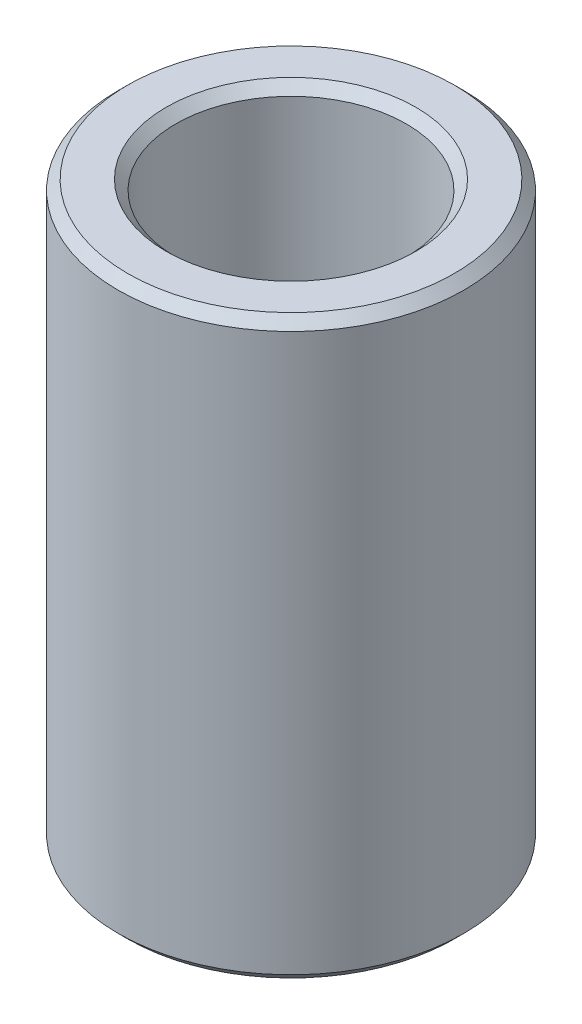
ISO-10303-21;
HEADER;
FILE_DESCRIPTION(('STEP AP214'),'2;1');
FILE_NAME('part.step','',(''),(''),'','','');
FILE_SCHEMA(('AUTOMOTIVE_DESIGN { 1 0 10303 214 1 1 1 1 }'));
ENDSEC;
DATA;
#1=APPLICATION_CONTEXT('core data for automotive mechanical design processes');
#2=APPLICATION_PROTOCOL_DEFINITION('international standard','automotive_design',2000,#1);
#3=PRODUCT_CONTEXT('',#1,'mechanical');
#4=PRODUCT('Part','Part','',(#3));
#5=PRODUCT_RELATED_PRODUCT_CATEGORY('part','',(#4));
#6=PRODUCT_DEFINITION_FORMATION('','',#4);
#7=PRODUCT_DEFINITION_CONTEXT('part definition',#1,'design');
#8=PRODUCT_DEFINITION('design','',#6,#7);
#9=PRODUCT_DEFINITION_SHAPE('','',#8);
#10=(LENGTH_UNIT() NAMED_UNIT(*) SI_UNIT(.MILLI.,.METRE.));
#11=(NAMED_UNIT(*) PLANE_ANGLE_UNIT() SI_UNIT($,.RADIAN.));
#12=(NAMED_UNIT(*) SI_UNIT($,.STERADIAN.) SOLID_ANGLE_UNIT());
#13=UNCERTAINTY_MEASURE_WITH_UNIT(LENGTH_MEASURE(1.E-05),#10,'distance_accuracy_value','');
#14=(GEOMETRIC_REPRESENTATION_CONTEXT(3) GLOBAL_UNCERTAINTY_ASSIGNED_CONTEXT((#13)) GLOBAL_UNIT_ASSIGNED_CONTEXT((#10,
#11,#12)) REPRESENTATION_CONTEXT('',''));
#15=CARTESIAN_POINT('',(0.,0.,0.));
#16=DIRECTION('',(0.,0.,1.));
#17=DIRECTION('',(1.,0.,0.));
#18=AXIS2_PLACEMENT_3D('',#15,#16,#17);
#19=CARTESIAN_POINT('',(0.,15.,0.));
#20=DIRECTION('',(0.,-1.,0.));
#21=DIRECTION('',(0.,0.,-1.));
#22=AXIS2_PLACEMENT_3D('',#19,#20,#21);
#23=CYLINDRICAL_SURFACE('',#22,4.5);
#24=CARTESIAN_POINT('',(0.,0.25,0.));
#25=DIRECTION('',(0.,1.,0.));
#26=DIRECTION('',(0.,0.,1.));
#27=AXIS2_PLACEMENT_3D('',#24,#25,#26);
#28=CIRCLE('',#27,4.5);
#29=CARTESIAN_POINT('',(0.,0.25,4.5));
#30=VERTEX_POINT('',#29);
#31=EDGE_CURVE('E9183',#30,#30,#28,.T.);
#32=ORIENTED_EDGE('',*,*,#31,.T.);
#33=EDGE_LOOP('',(#32));
#34=FACE_BOUND('',#33,.T.);
#35=CARTESIAN_POINT('',(0.,14.75,0.));
#36=DIRECTION('',(0.,1.,0.));
#37=DIRECTION('',(0.,0.,1.));
#38=AXIS2_PLACEMENT_3D('',#35,#36,#37);
#39=CIRCLE('',#38,4.5);
#40=CARTESIAN_POINT('',(0.,14.75,4.5));
#41=VERTEX_POINT('',#40);
#42=EDGE_CURVE('E9187',#41,#41,#39,.F.);
#43=ORIENTED_EDGE('',*,*,#42,.T.);
#44=EDGE_LOOP('',(#43));
#45=FACE_BOUND('',#44,.T.);
#46=ADVANCED_FACE('F9173',(#34,#45),#23,.T.);
#47=CARTESIAN_POINT('',(0.,15.,0.));
#48=DIRECTION('',(0.,1.,0.));
#49=DIRECTION('',(0.,0.,1.));
#50=AXIS2_PLACEMENT_3D('',#47,#48,#49);
#51=PLANE('',#50);
#52=CARTESIAN_POINT('',(0.,15.,0.));
#53=DIRECTION('',(0.,1.,0.));
#54=DIRECTION('',(0.,0.,1.));
#55=AXIS2_PLACEMENT_3D('',#52,#53,#54);
#56=CIRCLE('',#55,3.25);
#57=CARTESIAN_POINT('',(0.,15.,3.25));
#58=VERTEX_POINT('',#57);
#59=EDGE_CURVE('E10',#58,#58,#56,.F.);
#60=ORIENTED_EDGE('',*,*,#59,.T.);
#61=EDGE_LOOP('',(#60));
#62=FACE_BOUND('',#61,.T.);
#63=CARTESIAN_POINT('',(0.,15.,0.));
#64=DIRECTION('',(0.,1.,0.));
#65=DIRECTION('',(0.,0.,1.));
#66=AXIS2_PLACEMENT_3D('',#63,#64,#65);
#67=CIRCLE('',#66,4.25);
#68=CARTESIAN_POINT('',(0.,15.,4.25));
#69=VERTEX_POINT('',#68);
#70=EDGE_CURVE('E9179',#69,#69,#67,.T.);
#71=ORIENTED_EDGE('',*,*,#70,.T.);
#72=EDGE_LOOP('',(#71));
#73=FACE_BOUND('',#72,.T.);
#74=ADVANCED_FACE('F9217',(#62,#73),#51,.T.);
#75=CARTESIAN_POINT('',(0.,0.,0.));
#76=DIRECTION('',(0.,1.,0.));
#77=DIRECTION('',(0.,0.,1.));
#78=AXIS2_PLACEMENT_3D('',#75,#76,#77);
#79=PLANE('',#78);
#80=CARTESIAN_POINT('',(0.,0.,0.));
#81=DIRECTION('',(0.,1.,0.));
#82=DIRECTION('',(0.,0.,1.));
#83=AXIS2_PLACEMENT_3D('',#80,#81,#82);
#84=CIRCLE('',#83,3.25);
#85=CARTESIAN_POINT('',(0.,0.,3.25));
#86=VERTEX_POINT('',#85);
#87=EDGE_CURVE('E9198',#86,#86,#84,.T.);
#88=ORIENTED_EDGE('',*,*,#87,.T.);
#89=EDGE_LOOP('',(#88));
#90=FACE_BOUND('',#89,.T.);
#91=CARTESIAN_POINT('',(0.,0.,0.));
#92=DIRECTION('',(0.,1.,0.));
#93=DIRECTION('',(0.,0.,1.));
#94=AXIS2_PLACEMENT_3D('',#91,#92,#93);
#95=CIRCLE('',#94,4.25);
#96=CARTESIAN_POINT('',(0.,0.,4.25));
#97=VERTEX_POINT('',#96);
#98=EDGE_CURVE('E9201',#97,#97,#95,.F.);
#99=ORIENTED_EDGE('',*,*,#98,.T.);
#100=EDGE_LOOP('',(#99));
#101=FACE_BOUND('',#100,.T.);
#102=ADVANCED_FACE('F9205',(#90,#101),#79,.F.);
#103=CARTESIAN_POINT('',(0.,0.,0.));
#104=DIRECTION('',(0.,1.,0.));
#105=DIRECTION('',(0.,0.,1.));
#106=AXIS2_PLACEMENT_3D('',#103,#104,#105);
#107=CYLINDRICAL_SURFACE('',#106,3.);
#108=CARTESIAN_POINT('',(0.,0.250000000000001,0.));
#109=DIRECTION('',(0.,1.,0.));
#110=DIRECTION('',(0.,0.,1.));
#111=AXIS2_PLACEMENT_3D('',#108,#109,#110);
#112=CIRCLE('',#111,3.);
#113=CARTESIAN_POINT('',(0.,0.250000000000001,3.));
#114=VERTEX_POINT('',#113);
#115=EDGE_CURVE('E9192',#114,#114,#112,.F.);
#116=ORIENTED_EDGE('',*,*,#115,.T.);
#117=EDGE_LOOP('',(#116));
#118=FACE_BOUND('',#117,.T.);
#119=CARTESIAN_POINT('',(0.,14.75,0.));
#120=DIRECTION('',(0.,1.,0.));
#121=DIRECTION('',(0.,0.,1.));
#122=AXIS2_PLACEMENT_3D('',#119,#120,#121);
#123=CIRCLE('',#122,3.);
#124=CARTESIAN_POINT('',(0.,14.75,3.));
#125=VERTEX_POINT('',#124);
#126=EDGE_CURVE('E9195',#125,#125,#123,.T.);
#127=ORIENTED_EDGE('',*,*,#126,.T.);
#128=EDGE_LOOP('',(#127));
#129=FACE_BOUND('',#128,.T.);
#130=ADVANCED_FACE('F9232',(#118,#129),#107,.F.);
#131=CARTESIAN_POINT('',(0.,0.,0.));
#132=DIRECTION('',(0.,-1.,0.));
#133=DIRECTION('',(0.,0.,-1.));
#134=AXIS2_PLACEMENT_3D('',#131,#132,#133);
#135=CONICAL_SURFACE('',#134,3.25,0.785398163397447);
#136=ORIENTED_EDGE('',*,*,#115,.F.);
#137=EDGE_LOOP('',(#136));
#138=FACE_BOUND('',#137,.T.);
#139=ORIENTED_EDGE('',*,*,#87,.F.);
#140=EDGE_LOOP('',(#139));
#141=FACE_BOUND('',#140,.T.);
#142=ADVANCED_FACE('F9211',(#138,#141),#135,.F.);
#143=CARTESIAN_POINT('',(0.,0.25,0.));
#144=DIRECTION('',(0.,1.,0.));
#145=DIRECTION('',(0.,0.,1.));
#146=AXIS2_PLACEMENT_3D('',#143,#144,#145);
#147=CONICAL_SURFACE('',#146,4.5,0.78539816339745);
#148=ORIENTED_EDGE('',*,*,#98,.F.);
#149=EDGE_LOOP('',(#148));
#150=FACE_BOUND('',#149,.T.);
#151=ORIENTED_EDGE('',*,*,#31,.F.);
#152=EDGE_LOOP('',(#151));
#153=FACE_BOUND('',#152,.T.);
#154=ADVANCED_FACE('F9207',(#150,#153),#147,.T.);
#155=CARTESIAN_POINT('',(0.,14.75,0.));
#156=DIRECTION('',(0.,1.,0.));
#157=DIRECTION('',(0.,0.,1.));
#158=AXIS2_PLACEMENT_3D('',#155,#156,#157);
#159=CONICAL_SURFACE('',#158,3.,0.785398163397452);
#160=ORIENTED_EDGE('',*,*,#59,.F.);
#161=EDGE_LOOP('',(#160));
#162=FACE_BOUND('',#161,.T.);
#163=ORIENTED_EDGE('',*,*,#126,.F.);
#164=EDGE_LOOP('',(#163));
#165=FACE_BOUND('',#164,.T.);
#166=ADVANCED_FACE('F9210',(#162,#165),#159,.F.);
#167=CARTESIAN_POINT('',(0.,15.,0.));
#168=DIRECTION('',(0.,-1.,0.));
#169=DIRECTION('',(0.,0.,-1.));
#170=AXIS2_PLACEMENT_3D('',#167,#168,#169);
#171=CONICAL_SURFACE('',#170,4.25,0.785398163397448);
#172=ORIENTED_EDGE('',*,*,#42,.F.);
#173=EDGE_LOOP('',(#172));
#174=FACE_BOUND('',#173,.T.);
#175=ORIENTED_EDGE('',*,*,#70,.F.);
#176=EDGE_LOOP('',(#175));
#177=FACE_BOUND('',#176,.T.);
#178=ADVANCED_FACE('F9220',(#174,#177),#171,.T.);
#179=CLOSED_SHELL('',(#46,#74,#102,#130,#142,#154,#166,#178));
#180=MANIFOLD_SOLID_BREP('B2',#179);
#181=ADVANCED_BREP_SHAPE_REPRESENTATION('',(#18,#180),#14);
#182=SHAPE_DEFINITION_REPRESENTATION(#9,#181);
ENDSEC;
END-ISO-10303-21;
